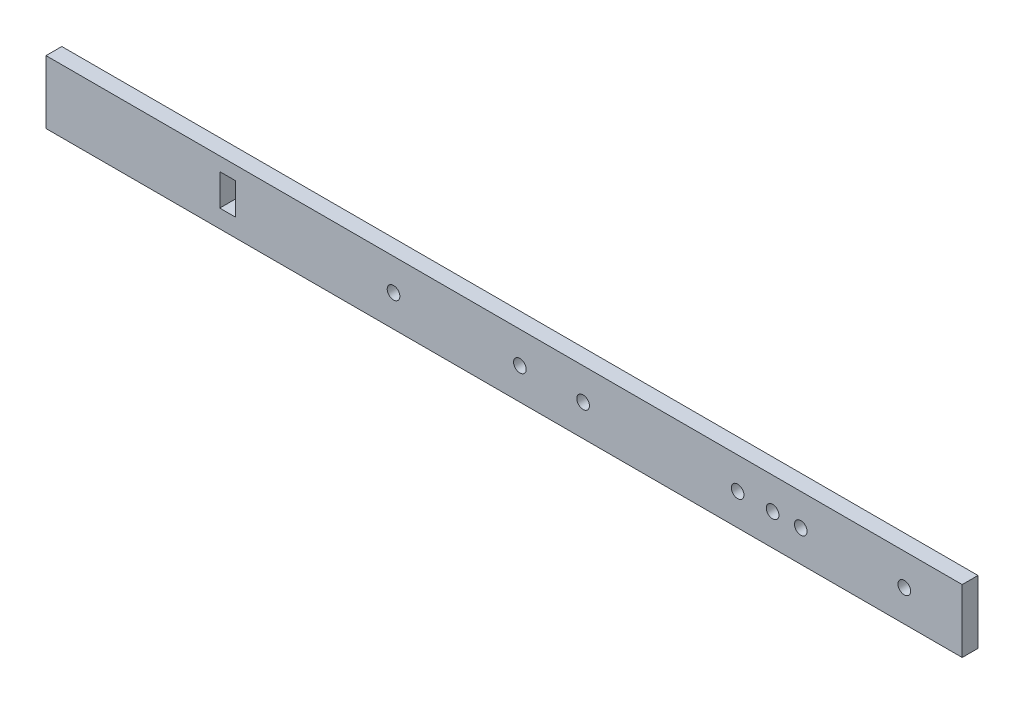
ISO-10303-21;
HEADER;
FILE_DESCRIPTION(('STEP AP214'),'2;1');
FILE_NAME('part.step','',(''),(''),'','','');
FILE_SCHEMA(('AUTOMOTIVE_DESIGN { 1 0 10303 214 1 1 1 1 }'));
ENDSEC;
DATA;
#1=APPLICATION_CONTEXT('core data for automotive mechanical design processes');
#2=APPLICATION_PROTOCOL_DEFINITION('international standard','automotive_design',2000,#1);
#3=PRODUCT_CONTEXT('',#1,'mechanical');
#4=PRODUCT('Part','Part','',(#3));
#5=PRODUCT_RELATED_PRODUCT_CATEGORY('part','',(#4));
#6=PRODUCT_DEFINITION_FORMATION('','',#4);
#7=PRODUCT_DEFINITION_CONTEXT('part definition',#1,'design');
#8=PRODUCT_DEFINITION('design','',#6,#7);
#9=PRODUCT_DEFINITION_SHAPE('','',#8);
#10=(LENGTH_UNIT() NAMED_UNIT(*) SI_UNIT(.MILLI.,.METRE.));
#11=(NAMED_UNIT(*) PLANE_ANGLE_UNIT() SI_UNIT($,.RADIAN.));
#12=(NAMED_UNIT(*) SI_UNIT($,.STERADIAN.) SOLID_ANGLE_UNIT());
#13=UNCERTAINTY_MEASURE_WITH_UNIT(LENGTH_MEASURE(1.E-05),#10,'distance_accuracy_value','');
#14=(GEOMETRIC_REPRESENTATION_CONTEXT(3) GLOBAL_UNCERTAINTY_ASSIGNED_CONTEXT((#13)) GLOBAL_UNIT_ASSIGNED_CONTEXT((#10,
#11,#12)) REPRESENTATION_CONTEXT('',''));
#15=CARTESIAN_POINT('',(0.,0.,0.));
#16=DIRECTION('',(0.,0.,1.));
#17=DIRECTION('',(1.,0.,0.));
#18=AXIS2_PLACEMENT_3D('',#15,#16,#17);
#19=CARTESIAN_POINT('',(-110.,10.,5.));
#20=DIRECTION('',(1.,0.,0.));
#21=DIRECTION('',(0.,0.,-1.));
#22=AXIS2_PLACEMENT_3D('',#19,#20,#21);
#23=PLANE('',#22);
#24=DIRECTION('',(0.,-1.,0.));
#25=VECTOR('',#24,1.);
#26=CARTESIAN_POINT('',(-110.,10.,0.));
#27=LINE('',#26,#25);
#28=CARTESIAN_POINT('',(-110.,10.,0.));
#29=VERTEX_POINT('',#28);
#30=CARTESIAN_POINT('',(-110.,-10.,0.));
#31=VERTEX_POINT('',#30);
#32=EDGE_CURVE('E173',#29,#31,#27,.T.);
#33=ORIENTED_EDGE('',*,*,#32,.T.);
#34=DIRECTION('',(0.,0.,-1.));
#35=VECTOR('',#34,1.);
#36=CARTESIAN_POINT('',(-110.,-10.,5.));
#37=LINE('',#36,#35);
#38=CARTESIAN_POINT('',(-110.,-10.,5.));
#39=VERTEX_POINT('',#38);
#40=EDGE_CURVE('E11',#39,#31,#37,.T.);
#41=ORIENTED_EDGE('',*,*,#40,.F.);
#42=DIRECTION('',(0.,-1.,0.));
#43=VECTOR('',#42,1.);
#44=CARTESIAN_POINT('',(-110.,10.,5.));
#45=LINE('',#44,#43);
#46=CARTESIAN_POINT('',(-110.,10.,5.));
#47=VERTEX_POINT('',#46);
#48=EDGE_CURVE('E176',#47,#39,#45,.T.);
#49=ORIENTED_EDGE('',*,*,#48,.F.);
#50=DIRECTION('',(0.,0.,-1.));
#51=VECTOR('',#50,1.);
#52=CARTESIAN_POINT('',(-110.,10.,5.));
#53=LINE('',#52,#51);
#54=EDGE_CURVE('E186',#47,#29,#53,.T.);
#55=ORIENTED_EDGE('',*,*,#54,.T.);
#56=EDGE_LOOP('',(#33,#41,#49,#55));
#57=FACE_BOUND('',#56,.T.);
#58=ADVANCED_FACE('F33',(#57),#23,.F.);
#59=CARTESIAN_POINT('',(-110.,-10.,5.));
#60=DIRECTION('',(0.,1.,0.));
#61=DIRECTION('',(0.,0.,1.));
#62=AXIS2_PLACEMENT_3D('',#59,#60,#61);
#63=PLANE('',#62);
#64=DIRECTION('',(1.,0.,0.));
#65=VECTOR('',#64,1.);
#66=CARTESIAN_POINT('',(-110.,-10.,0.));
#67=LINE('',#66,#65);
#68=CARTESIAN_POINT('',(180.,-10.,0.));
#69=VERTEX_POINT('',#68);
#70=EDGE_CURVE('E189',#31,#69,#67,.T.);
#71=ORIENTED_EDGE('',*,*,#70,.T.);
#72=DIRECTION('',(0.,0.,-1.));
#73=VECTOR('',#72,1.);
#74=CARTESIAN_POINT('',(180.,-10.,5.));
#75=LINE('',#74,#73);
#76=CARTESIAN_POINT('',(180.,-10.,5.));
#77=VERTEX_POINT('',#76);
#78=EDGE_CURVE('E40',#77,#69,#75,.T.);
#79=ORIENTED_EDGE('',*,*,#78,.F.);
#80=DIRECTION('',(1.,0.,0.));
#81=VECTOR('',#80,1.);
#82=CARTESIAN_POINT('',(-110.,-10.,5.));
#83=LINE('',#82,#81);
#84=EDGE_CURVE('E179',#39,#77,#83,.T.);
#85=ORIENTED_EDGE('',*,*,#84,.F.);
#86=ORIENTED_EDGE('',*,*,#40,.T.);
#87=EDGE_LOOP('',(#71,#79,#85,#86));
#88=FACE_BOUND('',#87,.T.);
#89=ADVANCED_FACE('F218',(#88),#63,.F.);
#90=CARTESIAN_POINT('',(180.,10.,5.));
#91=DIRECTION('',(-1.,0.,0.));
#92=DIRECTION('',(0.,0.,1.));
#93=AXIS2_PLACEMENT_3D('',#90,#91,#92);
#94=PLANE('',#93);
#95=DIRECTION('',(0.,1.,0.));
#96=VECTOR('',#95,1.);
#97=CARTESIAN_POINT('',(180.,10.,0.));
#98=LINE('',#97,#96);
#99=CARTESIAN_POINT('',(180.,10.,0.));
#100=VERTEX_POINT('',#99);
#101=EDGE_CURVE('E191',#69,#100,#98,.T.);
#102=ORIENTED_EDGE('',*,*,#101,.T.);
#103=DIRECTION('',(0.,0.,-1.));
#104=VECTOR('',#103,1.);
#105=CARTESIAN_POINT('',(180.,10.,5.));
#106=LINE('',#105,#104);
#107=CARTESIAN_POINT('',(180.,10.,5.));
#108=VERTEX_POINT('',#107);
#109=EDGE_CURVE('E196',#108,#100,#106,.T.);
#110=ORIENTED_EDGE('',*,*,#109,.F.);
#111=DIRECTION('',(0.,1.,0.));
#112=VECTOR('',#111,1.);
#113=CARTESIAN_POINT('',(180.,10.,5.));
#114=LINE('',#113,#112);
#115=EDGE_CURVE('E182',#77,#108,#114,.T.);
#116=ORIENTED_EDGE('',*,*,#115,.F.);
#117=ORIENTED_EDGE('',*,*,#78,.T.);
#118=EDGE_LOOP('',(#102,#110,#116,#117));
#119=FACE_BOUND('',#118,.T.);
#120=ADVANCED_FACE('F203',(#119),#94,.F.);
#121=CARTESIAN_POINT('',(-110.,10.,5.));
#122=DIRECTION('',(0.,-1.,0.));
#123=DIRECTION('',(0.,0.,-1.));
#124=AXIS2_PLACEMENT_3D('',#121,#122,#123);
#125=PLANE('',#124);
#126=DIRECTION('',(-1.,0.,0.));
#127=VECTOR('',#126,1.);
#128=CARTESIAN_POINT('',(-110.,10.,0.));
#129=LINE('',#128,#127);
#130=EDGE_CURVE('E180',#100,#29,#129,.T.);
#131=ORIENTED_EDGE('',*,*,#130,.T.);
#132=ORIENTED_EDGE('',*,*,#54,.F.);
#133=DIRECTION('',(-1.,0.,0.));
#134=VECTOR('',#133,1.);
#135=CARTESIAN_POINT('',(-110.,10.,5.));
#136=LINE('',#135,#134);
#137=EDGE_CURVE('E184',#108,#47,#136,.T.);
#138=ORIENTED_EDGE('',*,*,#137,.F.);
#139=ORIENTED_EDGE('',*,*,#109,.T.);
#140=EDGE_LOOP('',(#131,#132,#138,#139));
#141=FACE_BOUND('',#140,.T.);
#142=ADVANCED_FACE('F211',(#141),#125,.F.);
#143=CARTESIAN_POINT('',(0.,0.,5.));
#144=DIRECTION('',(0.,0.,1.));
#145=DIRECTION('',(1.,0.,0.));
#146=AXIS2_PLACEMENT_3D('',#143,#144,#145);
#147=PLANE('',#146);
#148=DIRECTION('',(0.,-1.,0.));
#149=VECTOR('',#148,1.);
#150=CARTESIAN_POINT('',(-55.,5.69877891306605,5.));
#151=LINE('',#150,#149);
#152=CARTESIAN_POINT('',(-55.,5.69877891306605,5.));
#153=VERTEX_POINT('',#152);
#154=CARTESIAN_POINT('',(-55.,-4.30122108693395,5.));
#155=VERTEX_POINT('',#154);
#156=EDGE_CURVE('E47',#153,#155,#151,.T.);
#157=ORIENTED_EDGE('',*,*,#156,.F.);
#158=DIRECTION('',(-1.,0.,0.));
#159=VECTOR('',#158,1.);
#160=CARTESIAN_POINT('',(-55.,5.69877891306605,5.));
#161=LINE('',#160,#159);
#162=CARTESIAN_POINT('',(-50.,5.69877891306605,5.));
#163=VERTEX_POINT('',#162);
#164=EDGE_CURVE('E115',#163,#153,#161,.T.);
#165=ORIENTED_EDGE('',*,*,#164,.F.);
#166=DIRECTION('',(0.,1.,0.));
#167=VECTOR('',#166,1.);
#168=CARTESIAN_POINT('',(-50.,5.69877891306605,5.));
#169=LINE('',#168,#167);
#170=CARTESIAN_POINT('',(-50.,-4.30122108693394,5.));
#171=VERTEX_POINT('',#170);
#172=EDGE_CURVE('E118',#171,#163,#169,.T.);
#173=ORIENTED_EDGE('',*,*,#172,.F.);
#174=DIRECTION('',(1.,0.,0.));
#175=VECTOR('',#174,1.);
#176=CARTESIAN_POINT('',(-55.,-4.30122108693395,5.));
#177=LINE('',#176,#175);
#178=EDGE_CURVE('E124',#155,#171,#177,.T.);
#179=ORIENTED_EDGE('',*,*,#178,.F.);
#180=EDGE_LOOP('',(#157,#165,#173,#179));
#181=FACE_BOUND('',#180,.T.);
#182=CARTESIAN_POINT('',(161.6668644,0.,5.));
#183=DIRECTION('',(0.,0.,1.));
#184=DIRECTION('',(1.,0.,0.));
#185=AXIS2_PLACEMENT_3D('',#182,#183,#184);
#186=CIRCLE('',#185,2.);
#187=CARTESIAN_POINT('',(163.6668644,0.,5.));
#188=VERTEX_POINT('',#187);
#189=EDGE_CURVE('E130',#188,#188,#186,.T.);
#190=ORIENTED_EDGE('',*,*,#189,.F.);
#191=EDGE_LOOP('',(#190));
#192=FACE_BOUND('',#191,.T.);
#193=CARTESIAN_POINT('',(108.9104104,0.,5.));
#194=DIRECTION('',(0.,0.,1.));
#195=DIRECTION('',(1.,0.,0.));
#196=AXIS2_PLACEMENT_3D('',#193,#194,#195);
#197=CIRCLE('',#196,2.);
#198=CARTESIAN_POINT('',(110.9104104,0.,5.));
#199=VERTEX_POINT('',#198);
#200=EDGE_CURVE('E137',#199,#199,#197,.T.);
#201=ORIENTED_EDGE('',*,*,#200,.F.);
#202=EDGE_LOOP('',(#201));
#203=FACE_BOUND('',#202,.T.);
#204=CARTESIAN_POINT('',(120.,0.,5.));
#205=DIRECTION('',(0.,0.,1.));
#206=DIRECTION('',(1.,0.,0.));
#207=AXIS2_PLACEMENT_3D('',#204,#205,#206);
#208=CIRCLE('',#207,2.);
#209=CARTESIAN_POINT('',(122.,0.,5.));
#210=VERTEX_POINT('',#209);
#211=EDGE_CURVE('E143',#210,#210,#208,.T.);
#212=ORIENTED_EDGE('',*,*,#211,.F.);
#213=EDGE_LOOP('',(#212));
#214=FACE_BOUND('',#213,.T.);
#215=CARTESIAN_POINT('',(40.,0.,5.));
#216=DIRECTION('',(0.,0.,1.));
#217=DIRECTION('',(1.,0.,0.));
#218=AXIS2_PLACEMENT_3D('',#215,#216,#217);
#219=CIRCLE('',#218,2.);
#220=CARTESIAN_POINT('',(42.,0.,5.));
#221=VERTEX_POINT('',#220);
#222=EDGE_CURVE('E149',#221,#221,#219,.T.);
#223=ORIENTED_EDGE('',*,*,#222,.F.);
#224=EDGE_LOOP('',(#223));
#225=FACE_BOUND('',#224,.T.);
#226=CARTESIAN_POINT('',(60.,0.,5.));
#227=DIRECTION('',(0.,0.,1.));
#228=DIRECTION('',(1.,0.,0.));
#229=AXIS2_PLACEMENT_3D('',#226,#227,#228);
#230=CIRCLE('',#229,2.);
#231=CARTESIAN_POINT('',(62.,0.,5.));
#232=VERTEX_POINT('',#231);
#233=EDGE_CURVE('E155',#232,#232,#230,.T.);
#234=ORIENTED_EDGE('',*,*,#233,.F.);
#235=EDGE_LOOP('',(#234));
#236=FACE_BOUND('',#235,.T.);
#237=CARTESIAN_POINT('',(128.9104104,0.,5.));
#238=DIRECTION('',(0.,0.,1.));
#239=DIRECTION('',(1.,0.,0.));
#240=AXIS2_PLACEMENT_3D('',#237,#238,#239);
#241=CIRCLE('',#240,2.);
#242=CARTESIAN_POINT('',(130.9104104,0.,5.));
#243=VERTEX_POINT('',#242);
#244=EDGE_CURVE('E161',#243,#243,#241,.T.);
#245=ORIENTED_EDGE('',*,*,#244,.F.);
#246=EDGE_LOOP('',(#245));
#247=FACE_BOUND('',#246,.T.);
#248=CARTESIAN_POINT('',(0.,0.,5.));
#249=DIRECTION('',(0.,0.,1.));
#250=DIRECTION('',(1.,0.,0.));
#251=AXIS2_PLACEMENT_3D('',#248,#249,#250);
#252=CIRCLE('',#251,2.);
#253=CARTESIAN_POINT('',(2.,0.,5.));
#254=VERTEX_POINT('',#253);
#255=EDGE_CURVE('E167',#254,#254,#252,.T.);
#256=ORIENTED_EDGE('',*,*,#255,.F.);
#257=EDGE_LOOP('',(#256));
#258=FACE_BOUND('',#257,.T.);
#259=ORIENTED_EDGE('',*,*,#48,.T.);
#260=ORIENTED_EDGE('',*,*,#84,.T.);
#261=ORIENTED_EDGE('',*,*,#115,.T.);
#262=ORIENTED_EDGE('',*,*,#137,.T.);
#263=EDGE_LOOP('',(#259,#260,#261,#262));
#264=FACE_BOUND('',#263,.T.);
#265=ADVANCED_FACE('F217',(#181,#192,#203,#214,#225,#236,#247,#258,#264),#147,.T.);
#266=CARTESIAN_POINT('',(0.,0.,0.));
#267=DIRECTION('',(0.,0.,1.));
#268=DIRECTION('',(1.,0.,0.));
#269=AXIS2_PLACEMENT_3D('',#266,#267,#268);
#270=PLANE('',#269);
#271=DIRECTION('',(-1.,0.,0.));
#272=VECTOR('',#271,1.);
#273=CARTESIAN_POINT('',(-55.,5.69877891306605,0.));
#274=LINE('',#273,#272);
#275=CARTESIAN_POINT('',(-50.,5.69877891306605,0.));
#276=VERTEX_POINT('',#275);
#277=CARTESIAN_POINT('',(-55.,5.69877891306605,0.));
#278=VERTEX_POINT('',#277);
#279=EDGE_CURVE('E105',#276,#278,#274,.T.);
#280=ORIENTED_EDGE('',*,*,#279,.T.);
#281=DIRECTION('',(0.,-1.,0.));
#282=VECTOR('',#281,1.);
#283=CARTESIAN_POINT('',(-55.,5.69877891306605,0.));
#284=LINE('',#283,#282);
#285=CARTESIAN_POINT('',(-55.,-4.30122108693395,0.));
#286=VERTEX_POINT('',#285);
#287=EDGE_CURVE('E99',#278,#286,#284,.T.);
#288=ORIENTED_EDGE('',*,*,#287,.T.);
#289=DIRECTION('',(1.,0.,0.));
#290=VECTOR('',#289,1.);
#291=CARTESIAN_POINT('',(-55.,-4.30122108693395,0.));
#292=LINE('',#291,#290);
#293=CARTESIAN_POINT('',(-50.,-4.30122108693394,0.));
#294=VERTEX_POINT('',#293);
#295=EDGE_CURVE('E108',#286,#294,#292,.T.);
#296=ORIENTED_EDGE('',*,*,#295,.T.);
#297=DIRECTION('',(0.,1.,0.));
#298=VECTOR('',#297,1.);
#299=CARTESIAN_POINT('',(-50.,5.69877891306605,0.));
#300=LINE('',#299,#298);
#301=EDGE_CURVE('E55',#294,#276,#300,.T.);
#302=ORIENTED_EDGE('',*,*,#301,.T.);
#303=EDGE_LOOP('',(#280,#288,#296,#302));
#304=FACE_BOUND('',#303,.T.);
#305=CARTESIAN_POINT('',(161.6668644,0.,0.));
#306=DIRECTION('',(0.,0.,1.));
#307=DIRECTION('',(1.,0.,0.));
#308=AXIS2_PLACEMENT_3D('',#305,#306,#307);
#309=CIRCLE('',#308,2.);
#310=CARTESIAN_POINT('',(163.6668644,0.,0.));
#311=VERTEX_POINT('',#310);
#312=EDGE_CURVE('E134',#311,#311,#309,.T.);
#313=ORIENTED_EDGE('',*,*,#312,.T.);
#314=EDGE_LOOP('',(#313));
#315=FACE_BOUND('',#314,.T.);
#316=CARTESIAN_POINT('',(108.9104104,0.,0.));
#317=DIRECTION('',(0.,0.,1.));
#318=DIRECTION('',(1.,0.,0.));
#319=AXIS2_PLACEMENT_3D('',#316,#317,#318);
#320=CIRCLE('',#319,2.);
#321=CARTESIAN_POINT('',(110.9104104,0.,0.));
#322=VERTEX_POINT('',#321);
#323=EDGE_CURVE('E140',#322,#322,#320,.T.);
#324=ORIENTED_EDGE('',*,*,#323,.T.);
#325=EDGE_LOOP('',(#324));
#326=FACE_BOUND('',#325,.T.);
#327=CARTESIAN_POINT('',(120.,0.,0.));
#328=DIRECTION('',(0.,0.,1.));
#329=DIRECTION('',(1.,0.,0.));
#330=AXIS2_PLACEMENT_3D('',#327,#328,#329);
#331=CIRCLE('',#330,2.);
#332=CARTESIAN_POINT('',(122.,0.,0.));
#333=VERTEX_POINT('',#332);
#334=EDGE_CURVE('E146',#333,#333,#331,.T.);
#335=ORIENTED_EDGE('',*,*,#334,.T.);
#336=EDGE_LOOP('',(#335));
#337=FACE_BOUND('',#336,.T.);
#338=CARTESIAN_POINT('',(40.,0.,0.));
#339=DIRECTION('',(0.,0.,1.));
#340=DIRECTION('',(1.,0.,0.));
#341=AXIS2_PLACEMENT_3D('',#338,#339,#340);
#342=CIRCLE('',#341,2.);
#343=CARTESIAN_POINT('',(42.,0.,0.));
#344=VERTEX_POINT('',#343);
#345=EDGE_CURVE('E152',#344,#344,#342,.T.);
#346=ORIENTED_EDGE('',*,*,#345,.T.);
#347=EDGE_LOOP('',(#346));
#348=FACE_BOUND('',#347,.T.);
#349=CARTESIAN_POINT('',(60.,0.,0.));
#350=DIRECTION('',(0.,0.,1.));
#351=DIRECTION('',(1.,0.,0.));
#352=AXIS2_PLACEMENT_3D('',#349,#350,#351);
#353=CIRCLE('',#352,2.);
#354=CARTESIAN_POINT('',(62.,0.,0.));
#355=VERTEX_POINT('',#354);
#356=EDGE_CURVE('E158',#355,#355,#353,.T.);
#357=ORIENTED_EDGE('',*,*,#356,.T.);
#358=EDGE_LOOP('',(#357));
#359=FACE_BOUND('',#358,.T.);
#360=CARTESIAN_POINT('',(128.9104104,0.,0.));
#361=DIRECTION('',(0.,0.,1.));
#362=DIRECTION('',(1.,0.,0.));
#363=AXIS2_PLACEMENT_3D('',#360,#361,#362);
#364=CIRCLE('',#363,2.);
#365=CARTESIAN_POINT('',(130.9104104,0.,0.));
#366=VERTEX_POINT('',#365);
#367=EDGE_CURVE('E164',#366,#366,#364,.T.);
#368=ORIENTED_EDGE('',*,*,#367,.T.);
#369=EDGE_LOOP('',(#368));
#370=FACE_BOUND('',#369,.T.);
#371=CARTESIAN_POINT('',(0.,0.,0.));
#372=DIRECTION('',(0.,0.,1.));
#373=DIRECTION('',(1.,0.,0.));
#374=AXIS2_PLACEMENT_3D('',#371,#372,#373);
#375=CIRCLE('',#374,2.);
#376=CARTESIAN_POINT('',(2.,0.,0.));
#377=VERTEX_POINT('',#376);
#378=EDGE_CURVE('E170',#377,#377,#375,.T.);
#379=ORIENTED_EDGE('',*,*,#378,.T.);
#380=EDGE_LOOP('',(#379));
#381=FACE_BOUND('',#380,.T.);
#382=ORIENTED_EDGE('',*,*,#32,.F.);
#383=ORIENTED_EDGE('',*,*,#130,.F.);
#384=ORIENTED_EDGE('',*,*,#101,.F.);
#385=ORIENTED_EDGE('',*,*,#70,.F.);
#386=EDGE_LOOP('',(#382,#383,#384,#385));
#387=FACE_BOUND('',#386,.T.);
#388=ADVANCED_FACE('F112',(#304,#315,#326,#337,#348,#359,#370,#381,#387),#270,.F.);
#389=CARTESIAN_POINT('',(0.,0.,0.));
#390=DIRECTION('',(0.,0.,1.));
#391=DIRECTION('',(1.,0.,0.));
#392=AXIS2_PLACEMENT_3D('',#389,#390,#391);
#393=CYLINDRICAL_SURFACE('',#392,2.);
#394=ORIENTED_EDGE('',*,*,#378,.F.);
#395=EDGE_LOOP('',(#394));
#396=FACE_BOUND('',#395,.T.);
#397=ORIENTED_EDGE('',*,*,#255,.T.);
#398=EDGE_LOOP('',(#397));
#399=FACE_BOUND('',#398,.T.);
#400=ADVANCED_FACE('F230',(#396,#399),#393,.F.);
#401=CARTESIAN_POINT('',(128.9104104,0.,0.));
#402=DIRECTION('',(0.,0.,1.));
#403=DIRECTION('',(1.,0.,0.));
#404=AXIS2_PLACEMENT_3D('',#401,#402,#403);
#405=CYLINDRICAL_SURFACE('',#404,2.);
#406=ORIENTED_EDGE('',*,*,#367,.F.);
#407=EDGE_LOOP('',(#406));
#408=FACE_BOUND('',#407,.T.);
#409=ORIENTED_EDGE('',*,*,#244,.T.);
#410=EDGE_LOOP('',(#409));
#411=FACE_BOUND('',#410,.T.);
#412=ADVANCED_FACE('F236',(#408,#411),#405,.F.);
#413=CARTESIAN_POINT('',(60.,0.,0.));
#414=DIRECTION('',(0.,0.,1.));
#415=DIRECTION('',(1.,0.,0.));
#416=AXIS2_PLACEMENT_3D('',#413,#414,#415);
#417=CYLINDRICAL_SURFACE('',#416,2.);
#418=ORIENTED_EDGE('',*,*,#356,.F.);
#419=EDGE_LOOP('',(#418));
#420=FACE_BOUND('',#419,.T.);
#421=ORIENTED_EDGE('',*,*,#233,.T.);
#422=EDGE_LOOP('',(#421));
#423=FACE_BOUND('',#422,.T.);
#424=ADVANCED_FACE('F240',(#420,#423),#417,.F.);
#425=CARTESIAN_POINT('',(40.,0.,0.));
#426=DIRECTION('',(0.,0.,1.));
#427=DIRECTION('',(1.,0.,0.));
#428=AXIS2_PLACEMENT_3D('',#425,#426,#427);
#429=CYLINDRICAL_SURFACE('',#428,2.);
#430=ORIENTED_EDGE('',*,*,#345,.F.);
#431=EDGE_LOOP('',(#430));
#432=FACE_BOUND('',#431,.T.);
#433=ORIENTED_EDGE('',*,*,#222,.T.);
#434=EDGE_LOOP('',(#433));
#435=FACE_BOUND('',#434,.T.);
#436=ADVANCED_FACE('F244',(#432,#435),#429,.F.);
#437=CARTESIAN_POINT('',(120.,0.,0.));
#438=DIRECTION('',(0.,0.,1.));
#439=DIRECTION('',(1.,0.,0.));
#440=AXIS2_PLACEMENT_3D('',#437,#438,#439);
#441=CYLINDRICAL_SURFACE('',#440,2.);
#442=ORIENTED_EDGE('',*,*,#334,.F.);
#443=EDGE_LOOP('',(#442));
#444=FACE_BOUND('',#443,.T.);
#445=ORIENTED_EDGE('',*,*,#211,.T.);
#446=EDGE_LOOP('',(#445));
#447=FACE_BOUND('',#446,.T.);
#448=ADVANCED_FACE('F248',(#444,#447),#441,.F.);
#449=CARTESIAN_POINT('',(108.9104104,0.,0.));
#450=DIRECTION('',(0.,0.,1.));
#451=DIRECTION('',(1.,0.,0.));
#452=AXIS2_PLACEMENT_3D('',#449,#450,#451);
#453=CYLINDRICAL_SURFACE('',#452,2.);
#454=ORIENTED_EDGE('',*,*,#323,.F.);
#455=EDGE_LOOP('',(#454));
#456=FACE_BOUND('',#455,.T.);
#457=ORIENTED_EDGE('',*,*,#200,.T.);
#458=EDGE_LOOP('',(#457));
#459=FACE_BOUND('',#458,.T.);
#460=ADVANCED_FACE('F252',(#456,#459),#453,.F.);
#461=CARTESIAN_POINT('',(161.6668644,0.,0.));
#462=DIRECTION('',(0.,0.,1.));
#463=DIRECTION('',(1.,0.,0.));
#464=AXIS2_PLACEMENT_3D('',#461,#462,#463);
#465=CYLINDRICAL_SURFACE('',#464,2.);
#466=ORIENTED_EDGE('',*,*,#312,.F.);
#467=EDGE_LOOP('',(#466));
#468=FACE_BOUND('',#467,.T.);
#469=ORIENTED_EDGE('',*,*,#189,.T.);
#470=EDGE_LOOP('',(#469));
#471=FACE_BOUND('',#470,.T.);
#472=ADVANCED_FACE('F256',(#468,#471),#465,.F.);
#473=CARTESIAN_POINT('',(-55.,5.69877891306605,0.));
#474=DIRECTION('',(-1.,0.,0.));
#475=DIRECTION('',(0.,0.,1.));
#476=AXIS2_PLACEMENT_3D('',#473,#474,#475);
#477=PLANE('',#476);
#478=ORIENTED_EDGE('',*,*,#156,.T.);
#479=DIRECTION('',(0.,0.,1.));
#480=VECTOR('',#479,1.);
#481=CARTESIAN_POINT('',(-55.,-4.30122108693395,0.));
#482=LINE('',#481,#480);
#483=EDGE_CURVE('E95',#286,#155,#482,.T.);
#484=ORIENTED_EDGE('',*,*,#483,.F.);
#485=ORIENTED_EDGE('',*,*,#287,.F.);
#486=DIRECTION('',(0.,0.,1.));
#487=VECTOR('',#486,1.);
#488=CARTESIAN_POINT('',(-55.,5.69877891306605,0.));
#489=LINE('',#488,#487);
#490=EDGE_CURVE('E128',#278,#153,#489,.T.);
#491=ORIENTED_EDGE('',*,*,#490,.T.);
#492=EDGE_LOOP('',(#478,#484,#485,#491));
#493=FACE_BOUND('',#492,.T.);
#494=ADVANCED_FACE('F97',(#493),#477,.F.);
#495=CARTESIAN_POINT('',(-55.,5.69877891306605,0.));
#496=DIRECTION('',(0.,1.,0.));
#497=DIRECTION('',(0.,0.,1.));
#498=AXIS2_PLACEMENT_3D('',#495,#496,#497);
#499=PLANE('',#498);
#500=ORIENTED_EDGE('',*,*,#164,.T.);
#501=ORIENTED_EDGE('',*,*,#490,.F.);
#502=ORIENTED_EDGE('',*,*,#279,.F.);
#503=DIRECTION('',(0.,0.,1.));
#504=VECTOR('',#503,1.);
#505=CARTESIAN_POINT('',(-50.,5.69877891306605,0.));
#506=LINE('',#505,#504);
#507=EDGE_CURVE('E131',#276,#163,#506,.T.);
#508=ORIENTED_EDGE('',*,*,#507,.T.);
#509=EDGE_LOOP('',(#500,#501,#502,#508));
#510=FACE_BOUND('',#509,.T.);
#511=ADVANCED_FACE('F263',(#510),#499,.F.);
#512=CARTESIAN_POINT('',(-50.,5.69877891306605,0.));
#513=DIRECTION('',(1.,0.,0.));
#514=DIRECTION('',(0.,0.,-1.));
#515=AXIS2_PLACEMENT_3D('',#512,#513,#514);
#516=PLANE('',#515);
#517=ORIENTED_EDGE('',*,*,#172,.T.);
#518=ORIENTED_EDGE('',*,*,#507,.F.);
#519=ORIENTED_EDGE('',*,*,#301,.F.);
#520=DIRECTION('',(0.,0.,1.));
#521=VECTOR('',#520,1.);
#522=CARTESIAN_POINT('',(-50.,-4.30122108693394,0.));
#523=LINE('',#522,#521);
#524=EDGE_CURVE('E104',#294,#171,#523,.T.);
#525=ORIENTED_EDGE('',*,*,#524,.T.);
#526=EDGE_LOOP('',(#517,#518,#519,#525));
#527=FACE_BOUND('',#526,.T.);
#528=ADVANCED_FACE('F266',(#527),#516,.F.);
#529=CARTESIAN_POINT('',(-55.,-4.30122108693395,0.));
#530=DIRECTION('',(0.,-1.,0.));
#531=DIRECTION('',(1.,0.,0.));
#532=AXIS2_PLACEMENT_3D('',#529,#530,#531);
#533=PLANE('',#532);
#534=ORIENTED_EDGE('',*,*,#178,.T.);
#535=ORIENTED_EDGE('',*,*,#524,.F.);
#536=ORIENTED_EDGE('',*,*,#295,.F.);
#537=ORIENTED_EDGE('',*,*,#483,.T.);
#538=EDGE_LOOP('',(#534,#535,#536,#537));
#539=FACE_BOUND('',#538,.T.);
#540=ADVANCED_FACE('F109',(#539),#533,.F.);
#541=CLOSED_SHELL('',(#58,#89,#120,#142,#265,#388,#400,#412,#424,#436,#448,#460,#472,#494,#511,
#528,#540));
#542=MANIFOLD_SOLID_BREP('B2',#541);
#543=ADVANCED_BREP_SHAPE_REPRESENTATION('',(#18,#542),#14);
#544=SHAPE_DEFINITION_REPRESENTATION(#9,#543);
ENDSEC;
END-ISO-10303-21;
